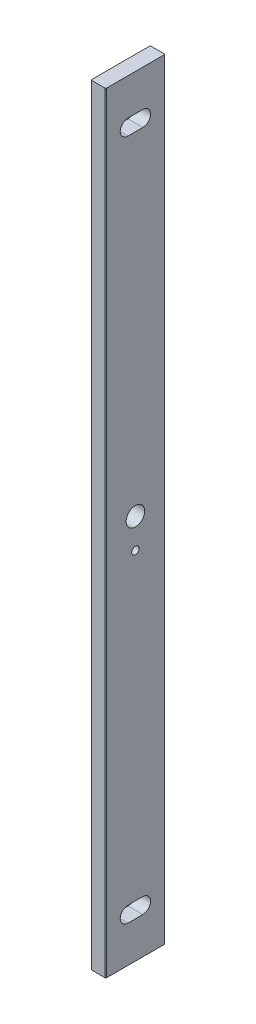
from build123d import *

# Parameters (mm, degrees)
ESQUISSE1_W                       = 520
ESQUISSE1_H                       = 40
BOSS_EXTRU_1_DEPTH                = 10
ENL_V_MAT_EXTRU_1_DEPTH           = 261.959767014
ENL_V_MAT_EXTRU_2_DEPTH           = 261.959767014
DIAM_TRE_DU_PER_AGE_5_0_5_1_D     = 5
DIAM_TRE_DU_PER_AGE_12_5_12_5_1_D = 12.5
CONG_1_R                          = 0.5


with BuildPart() as part:
    # Esquisse1 → Boss.-Extru.1 (new body)
    with BuildSketch(Plane(origin=(-5, 0, 0), x_dir=(0, -1, 0), z_dir=(-1, 0, 0))):
        Rectangle(ESQUISSE1_W, ESQUISSE1_H)
    extrude(amount=-BOSS_EXTRU_1_DEPTH)

    # Esquisse2 → Enl_v. mat.-Extru.1 (cut, through all)
    with BuildSketch(Plane.ZY.offset(5)):
        with BuildLine():
            Line((5, 235.25), (-5, 235.25))
            ThreePointArc((-5, 235.25), (-10.25, 230), (-5, 224.75))
            Line((-5, 224.75), (5, 224.75))
            ThreePointArc((5, 224.75), (10.25, 230), (5, 235.25))
        make_face()
    extrude(amount=-ENL_V_MAT_EXTRU_1_DEPTH, mode=Mode.SUBTRACT)

    # Esquisse3 → Enl_v. mat.-Extru.2 (cut, through all)
    with BuildSketch(Plane(origin=(5, 0, 0), x_dir=(0, 0, -1), z_dir=(1, 0, 0))):
        with BuildLine():
            Line((-5, -235.25), (5, -235.25))
            ThreePointArc((5, -235.25), (10.25, -230), (5, -224.75))
            Line((5, -224.75), (-5, -224.75))
            ThreePointArc((-5, -224.75), (-10.25, -230), (-5, -235.25))
        make_face()
    extrude(amount=-ENL_V_MAT_EXTRU_2_DEPTH, mode=Mode.SUBTRACT)

    # Diam_tre du per_age _5.0 _5_1 (through all)
    with Locations(Plane(origin=(5, 0, 0), x_dir=(0, 0, -1), z_dir=(1, 0, 0))):
        with Locations((0, -20)):
            Hole(DIAM_TRE_DU_PER_AGE_5_0_5_1_D / 2)

    # Diam_tre du per_age _12.5 _12.5_1 (through all)
    with Locations(Plane(origin=(5, 0, 0), x_dir=(0, 0, -1), z_dir=(1, 0, 0))):
        with Locations((0, 0)):
            Hole(DIAM_TRE_DU_PER_AGE_12_5_12_5_1_D / 2)

    # Cong_1
    cong_1_edges = [part.edges().sort_by_distance(p)[0] for p in [
        (5, 0, -20),
        (5, 0, 20),
        (-5, 0, -20),
        (-5, 0, 20),
    ]]
    fillet(cong_1_edges, radius=CONG_1_R)


solid = part.part
